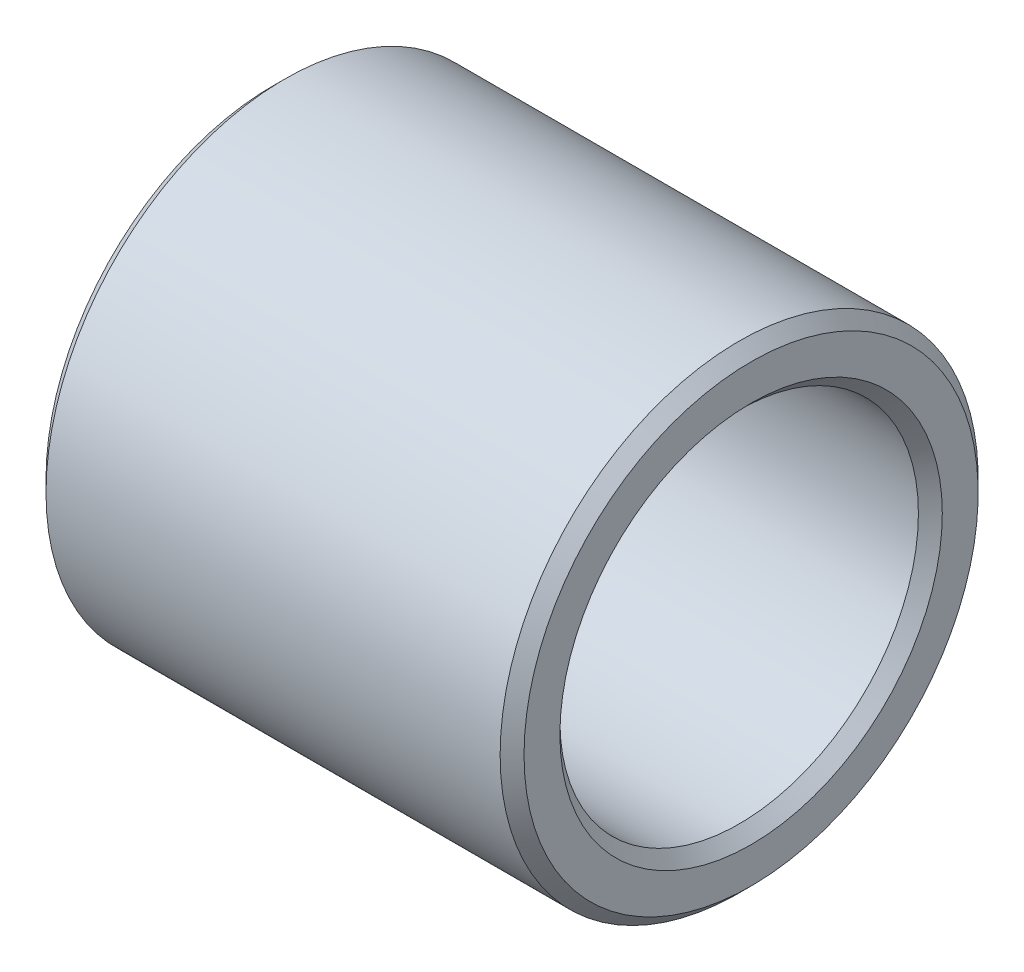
from build123d import *


with BuildPart() as part:
    # Esquisse1 → Base-R_volution (revolve)
    with BuildSketch(Plane.XY, mode=Mode.PRIVATE) as base_r_volution_sk:
        Polygon((-8, 6.4), (-8, 7.6), (-7.6, 8), (7.6, 8), (8, 7.6), (8, 6.4), (7.6, 6), (-7.6, 6), align=None)
    revolve(base_r_volution_sk.sketch.rotate(Axis((0, 0, 0), (1, 0, 0)), 90), axis=Axis((0, 0, 0), (1, 0, 0)))


solid = part.part
